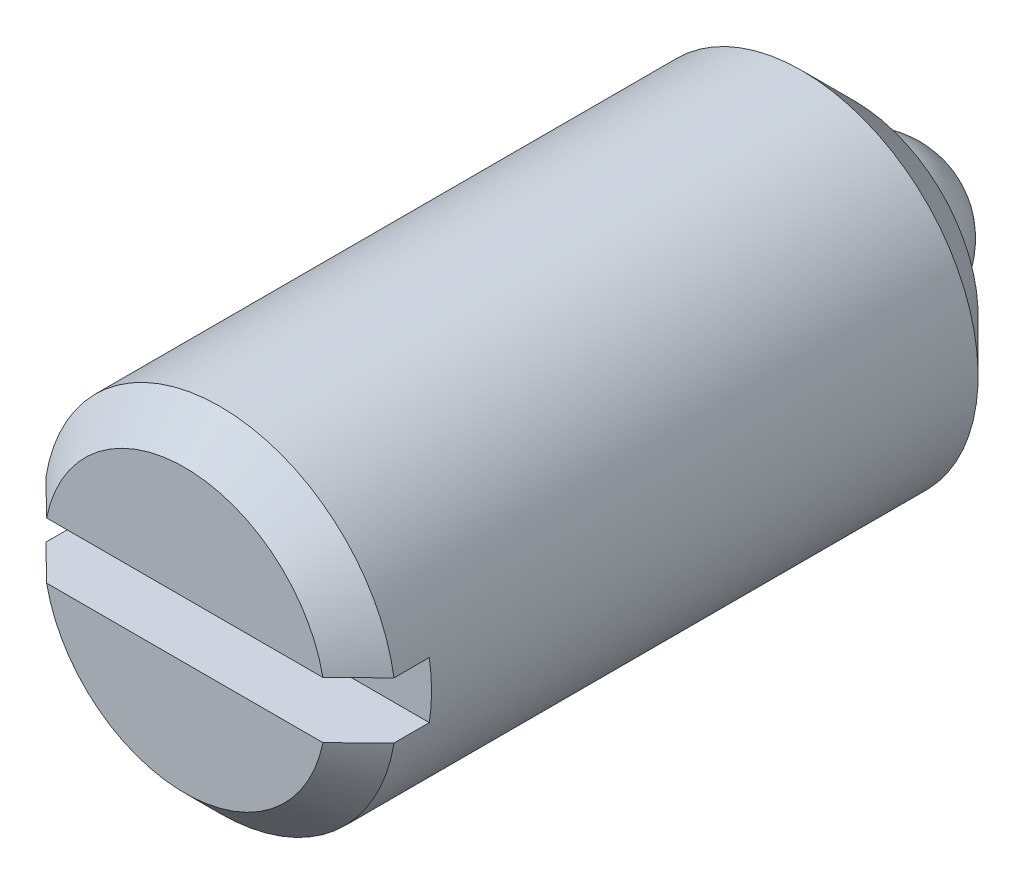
ISO-10303-21;
HEADER;
FILE_DESCRIPTION(('STEP AP214'),'2;1');
FILE_NAME('part.step','',(''),(''),'','','');
FILE_SCHEMA(('AUTOMOTIVE_DESIGN { 1 0 10303 214 1 1 1 1 }'));
ENDSEC;
DATA;
#1=APPLICATION_CONTEXT('core data for automotive mechanical design processes');
#2=APPLICATION_PROTOCOL_DEFINITION('international standard','automotive_design',2000,#1);
#3=PRODUCT_CONTEXT('',#1,'mechanical');
#4=PRODUCT('Part','Part','',(#3));
#5=PRODUCT_RELATED_PRODUCT_CATEGORY('part','',(#4));
#6=PRODUCT_DEFINITION_FORMATION('','',#4);
#7=PRODUCT_DEFINITION_CONTEXT('part definition',#1,'design');
#8=PRODUCT_DEFINITION('design','',#6,#7);
#9=PRODUCT_DEFINITION_SHAPE('','',#8);
#10=(LENGTH_UNIT() NAMED_UNIT(*) SI_UNIT(.MILLI.,.METRE.));
#11=(NAMED_UNIT(*) PLANE_ANGLE_UNIT() SI_UNIT($,.RADIAN.));
#12=(NAMED_UNIT(*) SI_UNIT($,.STERADIAN.) SOLID_ANGLE_UNIT());
#13=UNCERTAINTY_MEASURE_WITH_UNIT(LENGTH_MEASURE(1.E-05),#10,'distance_accuracy_value','');
#14=(GEOMETRIC_REPRESENTATION_CONTEXT(3) GLOBAL_UNCERTAINTY_ASSIGNED_CONTEXT((#13)) GLOBAL_UNIT_ASSIGNED_CONTEXT((#10,
#11,#12)) REPRESENTATION_CONTEXT('',''));
#15=CARTESIAN_POINT('',(0.,0.,0.));
#16=DIRECTION('',(0.,0.,1.));
#17=DIRECTION('',(1.,0.,0.));
#18=AXIS2_PLACEMENT_3D('',#15,#16,#17);
#19=CARTESIAN_POINT('',(0.,5.,21.5));
#20=DIRECTION('',(0.,0.,1.));
#21=DIRECTION('',(1.,0.,0.));
#22=AXIS2_PLACEMENT_3D('',#19,#20,#21);
#23=PLANE('',#22);
#24=DIRECTION('',(1.,0.,0.));
#25=VECTOR('',#24,1.);
#26=CARTESIAN_POINT('',(-4.93558507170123,0.8,21.5));
#27=LINE('',#26,#25);
#28=CARTESIAN_POINT('',(-3.91918358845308,0.8,21.5));
#29=VERTEX_POINT('',#28);
#30=CARTESIAN_POINT('',(3.91918358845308,0.8,21.5));
#31=VERTEX_POINT('',#30);
#32=EDGE_CURVE('E78',#29,#31,#27,.T.);
#33=ORIENTED_EDGE('',*,*,#32,.T.);
#34=CARTESIAN_POINT('',(0.,0.,21.5));
#35=DIRECTION('',(0.,0.,1.));
#36=DIRECTION('',(0.,-1.,0.));
#37=AXIS2_PLACEMENT_3D('',#34,#35,#36);
#38=CIRCLE('',#37,4.);
#39=EDGE_CURVE('E191',#31,#29,#38,.T.);
#40=ORIENTED_EDGE('',*,*,#39,.T.);
#41=EDGE_LOOP('',(#33,#40));
#42=FACE_BOUND('',#41,.T.);
#43=ADVANCED_FACE('F15',(#42),#23,.T.);
#44=CARTESIAN_POINT('',(0.,0.,-4.5));
#45=DIRECTION('',(0.,0.,-1.));
#46=DIRECTION('',(-1.,0.,0.));
#47=AXIS2_PLACEMENT_3D('',#44,#45,#46);
#48=CYLINDRICAL_SURFACE('',#47,5.);
#49=CARTESIAN_POINT('',(0.,0.,4.));
#50=DIRECTION('',(0.,0.,-1.));
#51=DIRECTION('',(0.,1.,0.));
#52=AXIS2_PLACEMENT_3D('',#49,#50,#51);
#53=CIRCLE('',#52,5.);
#54=CARTESIAN_POINT('',(0.,5.,4.));
#55=VERTEX_POINT('',#54);
#56=EDGE_CURVE('E119',#55,#55,#53,.F.);
#57=ORIENTED_EDGE('',*,*,#56,.T.);
#58=EDGE_LOOP('',(#57));
#59=FACE_BOUND('',#58,.T.);
#60=DIRECTION('',(0.,0.,1.));
#61=VECTOR('',#60,1.);
#62=CARTESIAN_POINT('',(-4.93558507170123,0.8,19.5));
#63=LINE('',#62,#61);
#64=CARTESIAN_POINT('',(-4.93558507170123,0.8,19.5));
#65=VERTEX_POINT('',#64);
#66=CARTESIAN_POINT('',(-4.93558507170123,0.8,20.5));
#67=VERTEX_POINT('',#66);
#68=EDGE_CURVE('E104',#65,#67,#63,.T.);
#69=ORIENTED_EDGE('',*,*,#68,.T.);
#70=CARTESIAN_POINT('',(0.,0.,20.5));
#71=DIRECTION('',(0.,0.,1.));
#72=DIRECTION('',(0.,-1.,0.));
#73=AXIS2_PLACEMENT_3D('',#70,#71,#72);
#74=CIRCLE('',#73,5.);
#75=CARTESIAN_POINT('',(4.93558507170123,0.8,20.5));
#76=VERTEX_POINT('',#75);
#77=EDGE_CURVE('E125',#67,#76,#74,.F.);
#78=ORIENTED_EDGE('',*,*,#77,.T.);
#79=DIRECTION('',(0.,0.,1.));
#80=VECTOR('',#79,1.);
#81=CARTESIAN_POINT('',(4.93558507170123,0.8,19.5));
#82=LINE('',#81,#80);
#83=CARTESIAN_POINT('',(4.93558507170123,0.8,19.5));
#84=VERTEX_POINT('',#83);
#85=EDGE_CURVE('E97',#84,#76,#82,.T.);
#86=ORIENTED_EDGE('',*,*,#85,.F.);
#87=CARTESIAN_POINT('',(0.,0.,19.5));
#88=DIRECTION('',(0.,0.,1.));
#89=DIRECTION('',(1.,0.,0.));
#90=AXIS2_PLACEMENT_3D('',#87,#88,#89);
#91=CIRCLE('',#90,5.);
#92=CARTESIAN_POINT('',(4.93558507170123,-0.8,19.5));
#93=VERTEX_POINT('',#92);
#94=EDGE_CURVE('E80',#93,#84,#91,.T.);
#95=ORIENTED_EDGE('',*,*,#94,.F.);
#96=DIRECTION('',(0.,0.,1.));
#97=VECTOR('',#96,1.);
#98=CARTESIAN_POINT('',(4.93558507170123,-0.8,19.5));
#99=LINE('',#98,#97);
#100=CARTESIAN_POINT('',(4.93558507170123,-0.8,20.5));
#101=VERTEX_POINT('',#100);
#102=EDGE_CURVE('E84',#93,#101,#99,.T.);
#103=ORIENTED_EDGE('',*,*,#102,.T.);
#104=CARTESIAN_POINT('',(0.,0.,20.5));
#105=DIRECTION('',(0.,0.,1.));
#106=DIRECTION('',(0.,-1.,0.));
#107=AXIS2_PLACEMENT_3D('',#104,#105,#106);
#108=CIRCLE('',#107,5.);
#109=CARTESIAN_POINT('',(-4.93558507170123,-0.8,20.5));
#110=VERTEX_POINT('',#109);
#111=EDGE_CURVE('E91',#101,#110,#108,.F.);
#112=ORIENTED_EDGE('',*,*,#111,.T.);
#113=DIRECTION('',(0.,0.,1.));
#114=VECTOR('',#113,1.);
#115=CARTESIAN_POINT('',(-4.93558507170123,-0.8,19.5));
#116=LINE('',#115,#114);
#117=CARTESIAN_POINT('',(-4.93558507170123,-0.8,19.5));
#118=VERTEX_POINT('',#117);
#119=EDGE_CURVE('E82',#118,#110,#116,.T.);
#120=ORIENTED_EDGE('',*,*,#119,.F.);
#121=EDGE_CURVE('E67',#65,#118,#91,.T.);
#122=ORIENTED_EDGE('',*,*,#121,.F.);
#123=EDGE_LOOP('',(#69,#78,#86,#95,#103,#112,#120,#122));
#124=FACE_BOUND('',#123,.T.);
#125=ADVANCED_FACE('F89',(#59,#124),#48,.T.);
#126=CARTESIAN_POINT('',(0.,2.25,2.5));
#127=DIRECTION('',(0.,0.,-1.));
#128=DIRECTION('',(-1.,0.,0.));
#129=AXIS2_PLACEMENT_3D('',#126,#127,#128);
#130=PLANE('',#129);
#131=CARTESIAN_POINT('',(0.,0.,2.5));
#132=DIRECTION('',(0.,0.,-1.));
#133=DIRECTION('',(0.,1.,0.));
#134=AXIS2_PLACEMENT_3D('',#131,#132,#133);
#135=CIRCLE('',#134,3.5);
#136=CARTESIAN_POINT('',(0.,3.5,2.5));
#137=VERTEX_POINT('',#136);
#138=EDGE_CURVE('E115',#137,#137,#135,.T.);
#139=ORIENTED_EDGE('',*,*,#138,.T.);
#140=EDGE_LOOP('',(#139));
#141=FACE_BOUND('',#140,.T.);
#142=CARTESIAN_POINT('',(0.,0.,2.5));
#143=DIRECTION('',(0.,0.,-1.));
#144=DIRECTION('',(-1.,0.,0.));
#145=AXIS2_PLACEMENT_3D('',#142,#143,#144);
#146=CIRCLE('',#145,2.25);
#147=CARTESIAN_POINT('',(-2.25,0.,2.5));
#148=VERTEX_POINT('',#147);
#149=EDGE_CURVE('E111',#148,#148,#146,.T.);
#150=ORIENTED_EDGE('',*,*,#149,.F.);
#151=EDGE_LOOP('',(#150));
#152=FACE_BOUND('',#151,.T.);
#153=ADVANCED_FACE('F157',(#141,#152),#130,.T.);
#154=CARTESIAN_POINT('',(0.,0.,-4.5));
#155=DIRECTION('',(0.,0.,-1.));
#156=DIRECTION('',(-1.,0.,0.));
#157=AXIS2_PLACEMENT_3D('',#154,#155,#156);
#158=CYLINDRICAL_SURFACE('',#157,2.25);
#159=CARTESIAN_POINT('',(0.,0.,2.25));
#160=DIRECTION('',(0.,0.,-1.));
#161=DIRECTION('',(-1.,0.,0.));
#162=AXIS2_PLACEMENT_3D('',#159,#160,#161);
#163=CIRCLE('',#162,2.25);
#164=CARTESIAN_POINT('',(-2.25,0.,2.25));
#165=VERTEX_POINT('',#164);
#166=EDGE_CURVE('E107',#165,#165,#163,.T.);
#167=ORIENTED_EDGE('',*,*,#166,.F.);
#168=EDGE_LOOP('',(#167));
#169=FACE_BOUND('',#168,.T.);
#170=ORIENTED_EDGE('',*,*,#149,.T.);
#171=EDGE_LOOP('',(#170));
#172=FACE_BOUND('',#171,.T.);
#173=ADVANCED_FACE('F160',(#169,#172),#158,.T.);
#174=CARTESIAN_POINT('',(0.,0.,2.25));
#175=DIRECTION('',(-1.,0.,0.));
#176=DIRECTION('',(0.,0.,1.));
#177=AXIS2_PLACEMENT_3D('',#174,#175,#176);
#178=SPHERICAL_SURFACE('',#177,2.25);
#179=CARTESIAN_POINT('',(0.,0.,2.25));
#180=DIRECTION('',(0.,0.,-1.));
#181=DIRECTION('',(-1.,0.,0.));
#182=AXIS2_PLACEMENT_3D('',#179,#180,#181);
#183=SPHERICAL_SURFACE('',#182,2.25);
#184=ORIENTED_EDGE('',*,*,#166,.T.);
#185=EDGE_LOOP('',(#184));
#186=FACE_BOUND('',#185,.T.);
#187=ADVANCED_FACE('F164',(#186),#183,.T.);
#188=DIRECTION('',(1.,0.,0.));
#189=VECTOR('',#188,1.);
#190=CARTESIAN_POINT('',(-4.93558507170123,-0.8,21.5));
#191=LINE('',#190,#189);
#192=CARTESIAN_POINT('',(-3.91918358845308,-0.8,21.5));
#193=VERTEX_POINT('',#192);
#194=CARTESIAN_POINT('',(3.91918358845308,-0.8,21.5));
#195=VERTEX_POINT('',#194);
#196=EDGE_CURVE('E195',#193,#195,#191,.T.);
#197=ORIENTED_EDGE('',*,*,#196,.F.);
#198=CARTESIAN_POINT('',(0.,0.,21.5));
#199=DIRECTION('',(0.,0.,1.));
#200=DIRECTION('',(0.,-1.,0.));
#201=AXIS2_PLACEMENT_3D('',#198,#199,#200);
#202=CIRCLE('',#201,4.);
#203=EDGE_CURVE('E9',#193,#195,#202,.T.);
#204=ORIENTED_EDGE('',*,*,#203,.T.);
#205=EDGE_LOOP('',(#197,#204));
#206=FACE_BOUND('',#205,.T.);
#207=ADVANCED_FACE('F168',(#206),#23,.T.);
#208=CARTESIAN_POINT('',(-4.93558507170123,0.8,19.5));
#209=DIRECTION('',(0.,-1.,0.));
#210=DIRECTION('',(1.,0.,0.));
#211=AXIS2_PLACEMENT_3D('',#208,#209,#210);
#212=PLANE('',#211);
#213=ORIENTED_EDGE('',*,*,#85,.T.);
#214=CARTESIAN_POINT('',(4.93558507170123,0.8,20.5));
#215=CARTESIAN_POINT('',(4.85102221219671,0.8,20.5834727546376));
#216=CARTESIAN_POINT('',(4.76643256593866,0.8,20.6669183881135));
#217=CARTESIAN_POINT('',(4.59718901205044,0.8,20.8337443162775));
#218=CARTESIAN_POINT('',(4.51253510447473,0.8,20.9171246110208));
#219=CARTESIAN_POINT('',(4.34315217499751,0.8,21.083808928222));
#220=CARTESIAN_POINT('',(4.25842315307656,0.8,21.1671129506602));
#221=CARTESIAN_POINT('',(4.08887483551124,0.8,21.3336292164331));
#222=CARTESIAN_POINT('',(4.00405553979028,0.8,21.4168414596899));
#223=CARTESIAN_POINT('',(3.91918358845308,0.8,21.5));
#224=B_SPLINE_CURVE_WITH_KNOTS('',3,(#214,#215,#216,#217,#218,#219,#220,#221,#222,#223),
.UNSPECIFIED.,.F.,.F.,(4,2,2,2,4),(0.,0.356464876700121,0.712929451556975,1.06939411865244,
1.42585908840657),.UNSPECIFIED.);
#225=EDGE_CURVE('E137',#76,#31,#224,.T.);
#226=ORIENTED_EDGE('',*,*,#225,.T.);
#227=ORIENTED_EDGE('',*,*,#32,.F.);
#228=CARTESIAN_POINT('',(-3.91918358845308,0.8,21.5));
#229=CARTESIAN_POINT('',(-4.00405553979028,0.8,21.4168414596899));
#230=CARTESIAN_POINT('',(-4.08887483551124,0.8,21.3336292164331));
#231=CARTESIAN_POINT('',(-4.25842315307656,0.8,21.1671129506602));
#232=CARTESIAN_POINT('',(-4.34315217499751,0.8,21.083808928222));
#233=CARTESIAN_POINT('',(-4.51253510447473,0.8,20.9171246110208));
#234=CARTESIAN_POINT('',(-4.59718901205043,0.8,20.8337443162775));
#235=CARTESIAN_POINT('',(-4.76643256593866,0.8,20.6669183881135));
#236=CARTESIAN_POINT('',(-4.85102221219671,0.8,20.5834727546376));
#237=CARTESIAN_POINT('',(-4.93558507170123,0.8,20.5));
#238=B_SPLINE_CURVE_WITH_KNOTS('',3,(#228,#229,#230,#231,#232,#233,#234,#235,#236,#237),
.UNSPECIFIED.,.F.,.F.,(4,2,2,2,4),(0.,0.356464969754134,0.712929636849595,1.06939421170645,
1.42585908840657),.UNSPECIFIED.);
#239=EDGE_CURVE('E129',#29,#67,#238,.T.);
#240=ORIENTED_EDGE('',*,*,#239,.T.);
#241=ORIENTED_EDGE('',*,*,#68,.F.);
#242=DIRECTION('',(1.,0.,0.));
#243=VECTOR('',#242,1.);
#244=CARTESIAN_POINT('',(-4.93558507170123,0.8,19.5));
#245=LINE('',#244,#243);
#246=EDGE_CURVE('E73',#65,#84,#245,.T.);
#247=ORIENTED_EDGE('',*,*,#246,.T.);
#248=EDGE_LOOP('',(#213,#226,#227,#240,#241,#247));
#249=FACE_BOUND('',#248,.T.);
#250=ADVANCED_FACE('F143',(#249),#212,.T.);
#251=CARTESIAN_POINT('',(-4.93558507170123,-0.8,19.5));
#252=DIRECTION('',(0.,-1.,0.));
#253=DIRECTION('',(1.,0.,0.));
#254=AXIS2_PLACEMENT_3D('',#251,#252,#253);
#255=PLANE('',#254);
#256=ORIENTED_EDGE('',*,*,#119,.T.);
#257=CARTESIAN_POINT('',(-4.93558507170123,-0.8,20.5));
#258=CARTESIAN_POINT('',(-4.85102221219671,-0.8,20.5834727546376));
#259=CARTESIAN_POINT('',(-4.76643256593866,-0.8,20.6669183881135));
#260=CARTESIAN_POINT('',(-4.59718901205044,-0.8,20.8337443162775));
#261=CARTESIAN_POINT('',(-4.51253510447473,-0.8,20.9171246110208));
#262=CARTESIAN_POINT('',(-4.34315217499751,-0.8,21.083808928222));
#263=CARTESIAN_POINT('',(-4.25842315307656,-0.8,21.1671129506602));
#264=CARTESIAN_POINT('',(-4.08887483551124,-0.8,21.3336292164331));
#265=CARTESIAN_POINT('',(-4.00405553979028,-0.8,21.4168414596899));
#266=CARTESIAN_POINT('',(-3.91918358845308,-0.8,21.5));
#267=B_SPLINE_CURVE_WITH_KNOTS('',3,(#257,#258,#259,#260,#261,#262,#263,#264,#265,#266),
.UNSPECIFIED.,.F.,.F.,(4,2,2,2,4),(0.,0.356464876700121,0.712929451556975,1.06939411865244,
1.42585908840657),.UNSPECIFIED.);
#268=EDGE_CURVE('E25',#110,#193,#267,.T.);
#269=ORIENTED_EDGE('',*,*,#268,.T.);
#270=ORIENTED_EDGE('',*,*,#196,.T.);
#271=CARTESIAN_POINT('',(3.91918358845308,-0.8,21.5));
#272=CARTESIAN_POINT('',(4.00405553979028,-0.8,21.4168414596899));
#273=CARTESIAN_POINT('',(4.08887483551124,-0.8,21.3336292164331));
#274=CARTESIAN_POINT('',(4.25842315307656,-0.8,21.1671129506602));
#275=CARTESIAN_POINT('',(4.34315217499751,-0.8,21.083808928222));
#276=CARTESIAN_POINT('',(4.51253510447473,-0.8,20.9171246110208));
#277=CARTESIAN_POINT('',(4.59718901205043,-0.8,20.8337443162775));
#278=CARTESIAN_POINT('',(4.76643256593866,-0.8,20.6669183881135));
#279=CARTESIAN_POINT('',(4.85102221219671,-0.8,20.5834727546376));
#280=CARTESIAN_POINT('',(4.93558507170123,-0.8,20.5));
#281=B_SPLINE_CURVE_WITH_KNOTS('',3,(#271,#272,#273,#274,#275,#276,#277,#278,#279,#280),
.UNSPECIFIED.,.F.,.F.,(4,2,2,2,4),(0.,0.356464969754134,0.712929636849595,1.06939421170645,
1.42585908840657),.UNSPECIFIED.);
#282=EDGE_CURVE('E199',#195,#101,#281,.T.);
#283=ORIENTED_EDGE('',*,*,#282,.T.);
#284=ORIENTED_EDGE('',*,*,#102,.F.);
#285=DIRECTION('',(1.,0.,0.));
#286=VECTOR('',#285,1.);
#287=CARTESIAN_POINT('',(-4.93558507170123,-0.8,19.5));
#288=LINE('',#287,#286);
#289=EDGE_CURVE('E70',#118,#93,#288,.T.);
#290=ORIENTED_EDGE('',*,*,#289,.F.);
#291=EDGE_LOOP('',(#256,#269,#270,#283,#284,#290));
#292=FACE_BOUND('',#291,.T.);
#293=ADVANCED_FACE('F81',(#292),#255,.F.);
#294=CARTESIAN_POINT('',(0.,0.,19.5));
#295=DIRECTION('',(0.,0.,1.));
#296=DIRECTION('',(1.,0.,0.));
#297=AXIS2_PLACEMENT_3D('',#294,#295,#296);
#298=PLANE('',#297);
#299=ORIENTED_EDGE('',*,*,#121,.T.);
#300=ORIENTED_EDGE('',*,*,#289,.T.);
#301=ORIENTED_EDGE('',*,*,#94,.T.);
#302=ORIENTED_EDGE('',*,*,#246,.F.);
#303=EDGE_LOOP('',(#299,#300,#301,#302));
#304=FACE_BOUND('',#303,.T.);
#305=ADVANCED_FACE('F69',(#304),#298,.T.);
#306=CARTESIAN_POINT('',(0.,0.,2.5));
#307=DIRECTION('',(0.,0.,1.));
#308=DIRECTION('',(0.,-1.,0.));
#309=AXIS2_PLACEMENT_3D('',#306,#307,#308);
#310=CONICAL_SURFACE('',#309,3.5,0.785398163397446);
#311=ORIENTED_EDGE('',*,*,#56,.F.);
#312=EDGE_LOOP('',(#311));
#313=FACE_BOUND('',#312,.T.);
#314=ORIENTED_EDGE('',*,*,#138,.F.);
#315=EDGE_LOOP('',(#314));
#316=FACE_BOUND('',#315,.T.);
#317=ADVANCED_FACE('F151',(#313,#316),#310,.T.);
#318=CARTESIAN_POINT('',(0.,0.,20.5));
#319=DIRECTION('',(0.,0.,-1.));
#320=DIRECTION('',(0.,1.,0.));
#321=AXIS2_PLACEMENT_3D('',#318,#319,#320);
#322=CONICAL_SURFACE('',#321,5.,0.78539816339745);
#323=ORIENTED_EDGE('',*,*,#239,.F.);
#324=ORIENTED_EDGE('',*,*,#39,.F.);
#325=ORIENTED_EDGE('',*,*,#225,.F.);
#326=ORIENTED_EDGE('',*,*,#77,.F.);
#327=EDGE_LOOP('',(#323,#324,#325,#326));
#328=FACE_BOUND('',#327,.T.);
#329=ADVANCED_FACE('F147',(#328),#322,.T.);
#330=CARTESIAN_POINT('',(0.,0.,20.5));
#331=DIRECTION('',(0.,0.,-1.));
#332=DIRECTION('',(0.,1.,0.));
#333=AXIS2_PLACEMENT_3D('',#330,#331,#332);
#334=CONICAL_SURFACE('',#333,5.,0.78539816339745);
#335=ORIENTED_EDGE('',*,*,#282,.F.);
#336=ORIENTED_EDGE('',*,*,#203,.F.);
#337=ORIENTED_EDGE('',*,*,#268,.F.);
#338=ORIENTED_EDGE('',*,*,#111,.F.);
#339=EDGE_LOOP('',(#335,#336,#337,#338));
#340=FACE_BOUND('',#339,.T.);
#341=ADVANCED_FACE('F17',(#340),#334,.T.);
#342=CLOSED_SHELL('',(#43,#125,#153,#173,#187,#207,#250,#293,#305,#317,#329,#341));
#343=MANIFOLD_SOLID_BREP('B1',#342);
#344=ADVANCED_BREP_SHAPE_REPRESENTATION('',(#18,#343),#14);
#345=SHAPE_DEFINITION_REPRESENTATION(#9,#344);
ENDSEC;
END-ISO-10303-21;
